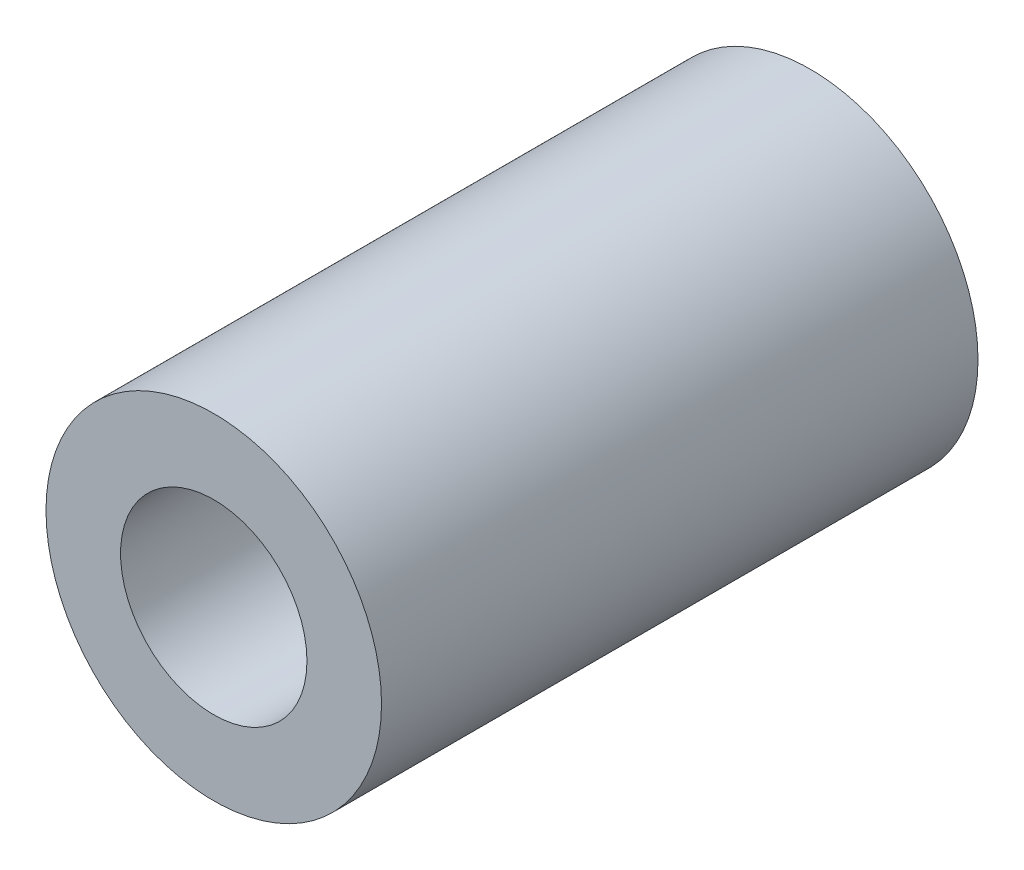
ISO-10303-21;
HEADER;
FILE_DESCRIPTION(('STEP AP214'),'2;1');
FILE_NAME('part.step','',(''),(''),'','','');
FILE_SCHEMA(('AUTOMOTIVE_DESIGN { 1 0 10303 214 1 1 1 1 }'));
ENDSEC;
DATA;
#1=APPLICATION_CONTEXT('core data for automotive mechanical design processes');
#2=APPLICATION_PROTOCOL_DEFINITION('international standard','automotive_design',2000,#1);
#3=PRODUCT_CONTEXT('',#1,'mechanical');
#4=PRODUCT('Part','Part','',(#3));
#5=PRODUCT_RELATED_PRODUCT_CATEGORY('part','',(#4));
#6=PRODUCT_DEFINITION_FORMATION('','',#4);
#7=PRODUCT_DEFINITION_CONTEXT('part definition',#1,'design');
#8=PRODUCT_DEFINITION('design','',#6,#7);
#9=PRODUCT_DEFINITION_SHAPE('','',#8);
#10=(LENGTH_UNIT() NAMED_UNIT(*) SI_UNIT(.MILLI.,.METRE.));
#11=(NAMED_UNIT(*) PLANE_ANGLE_UNIT() SI_UNIT($,.RADIAN.));
#12=(NAMED_UNIT(*) SI_UNIT($,.STERADIAN.) SOLID_ANGLE_UNIT());
#13=UNCERTAINTY_MEASURE_WITH_UNIT(LENGTH_MEASURE(1.E-05),#10,'distance_accuracy_value','');
#14=(GEOMETRIC_REPRESENTATION_CONTEXT(3) GLOBAL_UNCERTAINTY_ASSIGNED_CONTEXT((#13)) GLOBAL_UNIT_ASSIGNED_CONTEXT((#10,
#11,#12)) REPRESENTATION_CONTEXT('',''));
#15=CARTESIAN_POINT('',(0.,0.,0.));
#16=DIRECTION('',(0.,0.,1.));
#17=DIRECTION('',(1.,0.,0.));
#18=AXIS2_PLACEMENT_3D('',#15,#16,#17);
#19=CARTESIAN_POINT('',(0.,0.,48.));
#20=DIRECTION('',(0.,0.,1.));
#21=DIRECTION('',(1.,0.,0.));
#22=AXIS2_PLACEMENT_3D('',#19,#20,#21);
#23=PLANE('',#22);
#24=CARTESIAN_POINT('',(0.,0.,48.));
#25=DIRECTION('',(0.,0.,1.));
#26=DIRECTION('',(1.,0.,0.));
#27=AXIS2_PLACEMENT_3D('',#24,#25,#26);
#28=CIRCLE('',#27,13.5);
#29=CARTESIAN_POINT('',(13.5,0.,48.));
#30=VERTEX_POINT('',#29);
#31=EDGE_CURVE('E10',#30,#30,#28,.T.);
#32=ORIENTED_EDGE('',*,*,#31,.T.);
#33=EDGE_LOOP('',(#32));
#34=FACE_BOUND('',#33,.T.);
#35=CARTESIAN_POINT('',(0.,0.,48.));
#36=DIRECTION('',(0.,0.,1.));
#37=DIRECTION('',(1.,0.,0.));
#38=AXIS2_PLACEMENT_3D('',#35,#36,#37);
#39=CIRCLE('',#38,7.5);
#40=CARTESIAN_POINT('',(7.5,0.,48.));
#41=VERTEX_POINT('',#40);
#42=EDGE_CURVE('E50',#41,#41,#39,.T.);
#43=ORIENTED_EDGE('',*,*,#42,.F.);
#44=EDGE_LOOP('',(#43));
#45=FACE_BOUND('',#44,.T.);
#46=ADVANCED_FACE('F37',(#34,#45),#23,.T.);
#47=CARTESIAN_POINT('',(0.,0.,0.));
#48=DIRECTION('',(0.,0.,1.));
#49=DIRECTION('',(1.,0.,0.));
#50=AXIS2_PLACEMENT_3D('',#47,#48,#49);
#51=PLANE('',#50);
#52=CARTESIAN_POINT('',(0.,0.,0.));
#53=DIRECTION('',(0.,0.,1.));
#54=DIRECTION('',(1.,0.,0.));
#55=AXIS2_PLACEMENT_3D('',#52,#53,#54);
#56=CIRCLE('',#55,13.5);
#57=CARTESIAN_POINT('',(13.5,0.,0.));
#58=VERTEX_POINT('',#57);
#59=EDGE_CURVE('E41',#58,#58,#56,.T.);
#60=ORIENTED_EDGE('',*,*,#59,.F.);
#61=EDGE_LOOP('',(#60));
#62=FACE_BOUND('',#61,.T.);
#63=CARTESIAN_POINT('',(0.,0.,0.));
#64=DIRECTION('',(0.,0.,1.));
#65=DIRECTION('',(1.,0.,0.));
#66=AXIS2_PLACEMENT_3D('',#63,#64,#65);
#67=CIRCLE('',#66,7.5);
#68=CARTESIAN_POINT('',(7.5,0.,0.));
#69=VERTEX_POINT('',#68);
#70=EDGE_CURVE('E52',#69,#69,#67,.T.);
#71=ORIENTED_EDGE('',*,*,#70,.T.);
#72=EDGE_LOOP('',(#71));
#73=FACE_BOUND('',#72,.T.);
#74=ADVANCED_FACE('F64',(#62,#73),#51,.F.);
#75=CARTESIAN_POINT('',(0.,0.,48.));
#76=DIRECTION('',(0.,0.,-1.));
#77=DIRECTION('',(-1.,0.,0.));
#78=AXIS2_PLACEMENT_3D('',#75,#76,#77);
#79=CYLINDRICAL_SURFACE('',#78,13.5);
#80=ORIENTED_EDGE('',*,*,#31,.F.);
#81=EDGE_LOOP('',(#80));
#82=FACE_BOUND('',#81,.T.);
#83=ORIENTED_EDGE('',*,*,#59,.T.);
#84=EDGE_LOOP('',(#83));
#85=FACE_BOUND('',#84,.T.);
#86=ADVANCED_FACE('F39',(#82,#85),#79,.T.);
#87=CARTESIAN_POINT('',(0.,0.,48.));
#88=DIRECTION('',(0.,0.,-1.));
#89=DIRECTION('',(-1.,0.,0.));
#90=AXIS2_PLACEMENT_3D('',#87,#88,#89);
#91=CYLINDRICAL_SURFACE('',#90,7.5);
#92=ORIENTED_EDGE('',*,*,#42,.T.);
#93=EDGE_LOOP('',(#92));
#94=FACE_BOUND('',#93,.T.);
#95=ORIENTED_EDGE('',*,*,#70,.F.);
#96=EDGE_LOOP('',(#95));
#97=FACE_BOUND('',#96,.T.);
#98=ADVANCED_FACE('F60',(#94,#97),#91,.F.);
#99=CLOSED_SHELL('',(#46,#74,#86,#98));
#100=MANIFOLD_SOLID_BREP('B2',#99);
#101=ADVANCED_BREP_SHAPE_REPRESENTATION('',(#18,#100),#14);
#102=SHAPE_DEFINITION_REPRESENTATION(#9,#101);
ENDSEC;
END-ISO-10303-21;
